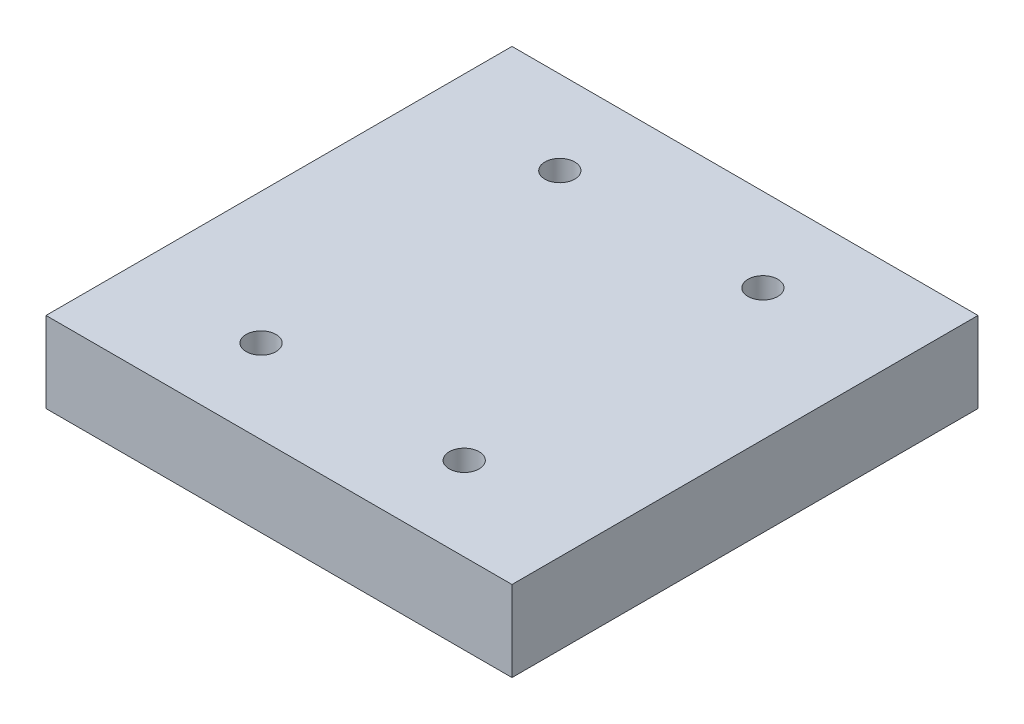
ISO-10303-21;
HEADER;
FILE_DESCRIPTION(('STEP AP214'),'2;1');
FILE_NAME('part.step','',(''),(''),'','','');
FILE_SCHEMA(('AUTOMOTIVE_DESIGN { 1 0 10303 214 1 1 1 1 }'));
ENDSEC;
DATA;
#1=APPLICATION_CONTEXT('core data for automotive mechanical design processes');
#2=APPLICATION_PROTOCOL_DEFINITION('international standard','automotive_design',2000,#1);
#3=PRODUCT_CONTEXT('',#1,'mechanical');
#4=PRODUCT('Part','Part','',(#3));
#5=PRODUCT_RELATED_PRODUCT_CATEGORY('part','',(#4));
#6=PRODUCT_DEFINITION_FORMATION('','',#4);
#7=PRODUCT_DEFINITION_CONTEXT('part definition',#1,'design');
#8=PRODUCT_DEFINITION('design','',#6,#7);
#9=PRODUCT_DEFINITION_SHAPE('','',#8);
#10=(LENGTH_UNIT() NAMED_UNIT(*) SI_UNIT(.MILLI.,.METRE.));
#11=(NAMED_UNIT(*) PLANE_ANGLE_UNIT() SI_UNIT($,.RADIAN.));
#12=(NAMED_UNIT(*) SI_UNIT($,.STERADIAN.) SOLID_ANGLE_UNIT());
#13=UNCERTAINTY_MEASURE_WITH_UNIT(LENGTH_MEASURE(1.E-05),#10,'distance_accuracy_value','');
#14=(GEOMETRIC_REPRESENTATION_CONTEXT(3) GLOBAL_UNCERTAINTY_ASSIGNED_CONTEXT((#13)) GLOBAL_UNIT_ASSIGNED_CONTEXT((#10,
#11,#12)) REPRESENTATION_CONTEXT('',''));
#15=CARTESIAN_POINT('',(0.,0.,0.));
#16=DIRECTION('',(0.,0.,1.));
#17=DIRECTION('',(1.,0.,0.));
#18=AXIS2_PLACEMENT_3D('',#15,#16,#17);
#19=CARTESIAN_POINT('',(78.,27.,78.));
#20=DIRECTION('',(-1.,0.,0.));
#21=DIRECTION('',(0.,0.,1.));
#22=AXIS2_PLACEMENT_3D('',#19,#20,#21);
#23=PLANE('',#22);
#24=DIRECTION('',(0.,0.,-1.));
#25=VECTOR('',#24,1.);
#26=CARTESIAN_POINT('',(78.,0.,78.));
#27=LINE('',#26,#25);
#28=CARTESIAN_POINT('',(78.,0.,78.));
#29=VERTEX_POINT('',#28);
#30=CARTESIAN_POINT('',(78.,0.,-78.));
#31=VERTEX_POINT('',#30);
#32=EDGE_CURVE('E94',#29,#31,#27,.T.);
#33=ORIENTED_EDGE('',*,*,#32,.T.);
#34=DIRECTION('',(0.,-1.,0.));
#35=VECTOR('',#34,1.);
#36=CARTESIAN_POINT('',(78.,27.,-78.));
#37=LINE('',#36,#35);
#38=CARTESIAN_POINT('',(78.,27.,-78.));
#39=VERTEX_POINT('',#38);
#40=EDGE_CURVE('E11',#39,#31,#37,.T.);
#41=ORIENTED_EDGE('',*,*,#40,.F.);
#42=DIRECTION('',(0.,0.,-1.));
#43=VECTOR('',#42,1.);
#44=CARTESIAN_POINT('',(78.,27.,78.));
#45=LINE('',#44,#43);
#46=CARTESIAN_POINT('',(78.,27.,78.));
#47=VERTEX_POINT('',#46);
#48=EDGE_CURVE('E82',#47,#39,#45,.T.);
#49=ORIENTED_EDGE('',*,*,#48,.F.);
#50=DIRECTION('',(0.,-1.,0.));
#51=VECTOR('',#50,1.);
#52=CARTESIAN_POINT('',(78.,27.,78.));
#53=LINE('',#52,#51);
#54=EDGE_CURVE('E90',#47,#29,#53,.T.);
#55=ORIENTED_EDGE('',*,*,#54,.T.);
#56=EDGE_LOOP('',(#33,#41,#49,#55));
#57=FACE_BOUND('',#56,.T.);
#58=ADVANCED_FACE('F31',(#57),#23,.F.);
#59=CARTESIAN_POINT('',(-78.,27.,-78.));
#60=DIRECTION('',(0.,0.,1.));
#61=DIRECTION('',(1.,0.,0.));
#62=AXIS2_PLACEMENT_3D('',#59,#60,#61);
#63=PLANE('',#62);
#64=DIRECTION('',(-1.,0.,0.));
#65=VECTOR('',#64,1.);
#66=CARTESIAN_POINT('',(-78.,0.,-78.));
#67=LINE('',#66,#65);
#68=CARTESIAN_POINT('',(-78.,0.,-78.));
#69=VERTEX_POINT('',#68);
#70=EDGE_CURVE('E86',#31,#69,#67,.T.);
#71=ORIENTED_EDGE('',*,*,#70,.T.);
#72=DIRECTION('',(0.,-1.,0.));
#73=VECTOR('',#72,1.);
#74=CARTESIAN_POINT('',(-78.,27.,-78.));
#75=LINE('',#74,#73);
#76=CARTESIAN_POINT('',(-78.,27.,-78.));
#77=VERTEX_POINT('',#76);
#78=EDGE_CURVE('E39',#77,#69,#75,.T.);
#79=ORIENTED_EDGE('',*,*,#78,.F.);
#80=DIRECTION('',(-1.,0.,0.));
#81=VECTOR('',#80,1.);
#82=CARTESIAN_POINT('',(-78.,27.,-78.));
#83=LINE('',#82,#81);
#84=EDGE_CURVE('E77',#39,#77,#83,.T.);
#85=ORIENTED_EDGE('',*,*,#84,.F.);
#86=ORIENTED_EDGE('',*,*,#40,.T.);
#87=EDGE_LOOP('',(#71,#79,#85,#86));
#88=FACE_BOUND('',#87,.T.);
#89=ADVANCED_FACE('F85',(#88),#63,.F.);
#90=CARTESIAN_POINT('',(-78.,27.,78.));
#91=DIRECTION('',(1.,0.,0.));
#92=DIRECTION('',(0.,0.,-1.));
#93=AXIS2_PLACEMENT_3D('',#90,#91,#92);
#94=PLANE('',#93);
#95=DIRECTION('',(0.,0.,1.));
#96=VECTOR('',#95,1.);
#97=CARTESIAN_POINT('',(-78.,0.,78.));
#98=LINE('',#97,#96);
#99=CARTESIAN_POINT('',(-78.,0.,78.));
#100=VERTEX_POINT('',#99);
#101=EDGE_CURVE('E64',#69,#100,#98,.T.);
#102=ORIENTED_EDGE('',*,*,#101,.T.);
#103=DIRECTION('',(0.,-1.,0.));
#104=VECTOR('',#103,1.);
#105=CARTESIAN_POINT('',(-78.,27.,78.));
#106=LINE('',#105,#104);
#107=CARTESIAN_POINT('',(-78.,27.,78.));
#108=VERTEX_POINT('',#107);
#109=EDGE_CURVE('E87',#108,#100,#106,.T.);
#110=ORIENTED_EDGE('',*,*,#109,.F.);
#111=DIRECTION('',(0.,0.,1.));
#112=VECTOR('',#111,1.);
#113=CARTESIAN_POINT('',(-78.,27.,78.));
#114=LINE('',#113,#112);
#115=EDGE_CURVE('E80',#77,#108,#114,.T.);
#116=ORIENTED_EDGE('',*,*,#115,.F.);
#117=ORIENTED_EDGE('',*,*,#78,.T.);
#118=EDGE_LOOP('',(#102,#110,#116,#117));
#119=FACE_BOUND('',#118,.T.);
#120=ADVANCED_FACE('F88',(#119),#94,.F.);
#121=CARTESIAN_POINT('',(-78.,27.,78.));
#122=DIRECTION('',(0.,0.,-1.));
#123=DIRECTION('',(-1.,0.,0.));
#124=AXIS2_PLACEMENT_3D('',#121,#122,#123);
#125=PLANE('',#124);
#126=DIRECTION('',(1.,0.,0.));
#127=VECTOR('',#126,1.);
#128=CARTESIAN_POINT('',(-78.,0.,78.));
#129=LINE('',#128,#127);
#130=EDGE_CURVE('E70',#100,#29,#129,.T.);
#131=ORIENTED_EDGE('',*,*,#130,.T.);
#132=ORIENTED_EDGE('',*,*,#54,.F.);
#133=DIRECTION('',(1.,0.,0.));
#134=VECTOR('',#133,1.);
#135=CARTESIAN_POINT('',(-78.,27.,78.));
#136=LINE('',#135,#134);
#137=EDGE_CURVE('E47',#108,#47,#136,.T.);
#138=ORIENTED_EDGE('',*,*,#137,.F.);
#139=ORIENTED_EDGE('',*,*,#109,.T.);
#140=EDGE_LOOP('',(#131,#132,#138,#139));
#141=FACE_BOUND('',#140,.T.);
#142=ADVANCED_FACE('F102',(#141),#125,.F.);
#143=CARTESIAN_POINT('',(78.,27.,-78.));
#144=DIRECTION('',(0.,-1.,0.));
#145=DIRECTION('',(0.,0.,-1.));
#146=AXIS2_PLACEMENT_3D('',#143,#144,#145);
#147=PLANE('',#146);
#148=CARTESIAN_POINT('',(-33.999999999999,27.,-50.0000000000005));
#149=DIRECTION('',(0.,-1.,0.));
#150=DIRECTION('',(0.,0.,-1.));
#151=AXIS2_PLACEMENT_3D('',#148,#149,#150);
#152=CIRCLE('',#151,5.);
#153=CARTESIAN_POINT('',(-33.999999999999,27.,-55.0000000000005));
#154=VERTEX_POINT('',#153);
#155=EDGE_CURVE('E123',#154,#154,#152,.T.);
#156=ORIENTED_EDGE('',*,*,#155,.T.);
#157=EDGE_LOOP('',(#156));
#158=FACE_BOUND('',#157,.T.);
#159=CARTESIAN_POINT('',(34.000000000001,27.,-50.));
#160=DIRECTION('',(0.,-1.,0.));
#161=DIRECTION('',(0.,0.,-1.));
#162=AXIS2_PLACEMENT_3D('',#159,#160,#161);
#163=CIRCLE('',#162,5.);
#164=CARTESIAN_POINT('',(34.000000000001,27.,-55.));
#165=VERTEX_POINT('',#164);
#166=EDGE_CURVE('E117',#165,#165,#163,.T.);
#167=ORIENTED_EDGE('',*,*,#166,.T.);
#168=EDGE_LOOP('',(#167));
#169=FACE_BOUND('',#168,.T.);
#170=CARTESIAN_POINT('',(-34.,27.,49.9999999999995));
#171=DIRECTION('',(0.,-1.,0.));
#172=DIRECTION('',(0.,0.,-1.));
#173=AXIS2_PLACEMENT_3D('',#170,#171,#172);
#174=CIRCLE('',#173,5.);
#175=CARTESIAN_POINT('',(-34.,27.,44.9999999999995));
#176=VERTEX_POINT('',#175);
#177=EDGE_CURVE('E111',#176,#176,#174,.T.);
#178=ORIENTED_EDGE('',*,*,#177,.T.);
#179=EDGE_LOOP('',(#178));
#180=FACE_BOUND('',#179,.T.);
#181=CARTESIAN_POINT('',(34.,27.,50.));
#182=DIRECTION('',(0.,-1.,0.));
#183=DIRECTION('',(0.,0.,-1.));
#184=AXIS2_PLACEMENT_3D('',#181,#182,#183);
#185=CIRCLE('',#184,5.);
#186=CARTESIAN_POINT('',(34.,27.,45.));
#187=VERTEX_POINT('',#186);
#188=EDGE_CURVE('E97',#187,#187,#185,.T.);
#189=ORIENTED_EDGE('',*,*,#188,.T.);
#190=EDGE_LOOP('',(#189));
#191=FACE_BOUND('',#190,.T.);
#192=ORIENTED_EDGE('',*,*,#48,.T.);
#193=ORIENTED_EDGE('',*,*,#84,.T.);
#194=ORIENTED_EDGE('',*,*,#115,.T.);
#195=ORIENTED_EDGE('',*,*,#137,.T.);
#196=EDGE_LOOP('',(#192,#193,#194,#195));
#197=FACE_BOUND('',#196,.T.);
#198=ADVANCED_FACE('F78',(#158,#169,#180,#191,#197),#147,.F.);
#199=CARTESIAN_POINT('',(78.,0.,-78.));
#200=DIRECTION('',(0.,-1.,0.));
#201=DIRECTION('',(0.,0.,-1.));
#202=AXIS2_PLACEMENT_3D('',#199,#200,#201);
#203=PLANE('',#202);
#204=CARTESIAN_POINT('',(-33.999999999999,0.,-50.0000000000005));
#205=DIRECTION('',(0.,-1.,0.));
#206=DIRECTION('',(0.,0.,-1.));
#207=AXIS2_PLACEMENT_3D('',#204,#205,#206);
#208=CIRCLE('',#207,5.);
#209=CARTESIAN_POINT('',(-33.999999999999,0.,-55.0000000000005));
#210=VERTEX_POINT('',#209);
#211=EDGE_CURVE('E126',#210,#210,#208,.T.);
#212=ORIENTED_EDGE('',*,*,#211,.F.);
#213=EDGE_LOOP('',(#212));
#214=FACE_BOUND('',#213,.T.);
#215=CARTESIAN_POINT('',(34.000000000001,0.,-50.));
#216=DIRECTION('',(0.,-1.,0.));
#217=DIRECTION('',(0.,0.,-1.));
#218=AXIS2_PLACEMENT_3D('',#215,#216,#217);
#219=CIRCLE('',#218,5.);
#220=CARTESIAN_POINT('',(34.000000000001,0.,-55.));
#221=VERTEX_POINT('',#220);
#222=EDGE_CURVE('E120',#221,#221,#219,.T.);
#223=ORIENTED_EDGE('',*,*,#222,.F.);
#224=EDGE_LOOP('',(#223));
#225=FACE_BOUND('',#224,.T.);
#226=CARTESIAN_POINT('',(-34.,0.,49.9999999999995));
#227=DIRECTION('',(0.,-1.,0.));
#228=DIRECTION('',(0.,0.,-1.));
#229=AXIS2_PLACEMENT_3D('',#226,#227,#228);
#230=CIRCLE('',#229,5.);
#231=CARTESIAN_POINT('',(-34.,0.,44.9999999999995));
#232=VERTEX_POINT('',#231);
#233=EDGE_CURVE('E114',#232,#232,#230,.T.);
#234=ORIENTED_EDGE('',*,*,#233,.F.);
#235=EDGE_LOOP('',(#234));
#236=FACE_BOUND('',#235,.T.);
#237=CARTESIAN_POINT('',(34.,0.,50.));
#238=DIRECTION('',(0.,-1.,0.));
#239=DIRECTION('',(0.,0.,-1.));
#240=AXIS2_PLACEMENT_3D('',#237,#238,#239);
#241=CIRCLE('',#240,5.);
#242=CARTESIAN_POINT('',(34.,0.,45.));
#243=VERTEX_POINT('',#242);
#244=EDGE_CURVE('E108',#243,#243,#241,.T.);
#245=ORIENTED_EDGE('',*,*,#244,.F.);
#246=EDGE_LOOP('',(#245));
#247=FACE_BOUND('',#246,.T.);
#248=ORIENTED_EDGE('',*,*,#32,.F.);
#249=ORIENTED_EDGE('',*,*,#130,.F.);
#250=ORIENTED_EDGE('',*,*,#101,.F.);
#251=ORIENTED_EDGE('',*,*,#70,.F.);
#252=EDGE_LOOP('',(#248,#249,#250,#251));
#253=FACE_BOUND('',#252,.T.);
#254=ADVANCED_FACE('F105',(#214,#225,#236,#247,#253),#203,.T.);
#255=CARTESIAN_POINT('',(34.,27.,50.));
#256=DIRECTION('',(0.,-1.,0.));
#257=DIRECTION('',(0.,0.,-1.));
#258=AXIS2_PLACEMENT_3D('',#255,#256,#257);
#259=CYLINDRICAL_SURFACE('',#258,5.);
#260=ORIENTED_EDGE('',*,*,#188,.F.);
#261=EDGE_LOOP('',(#260));
#262=FACE_BOUND('',#261,.T.);
#263=ORIENTED_EDGE('',*,*,#244,.T.);
#264=EDGE_LOOP('',(#263));
#265=FACE_BOUND('',#264,.T.);
#266=ADVANCED_FACE('F143',(#262,#265),#259,.F.);
#267=CARTESIAN_POINT('',(-34.,27.,49.9999999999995));
#268=DIRECTION('',(0.,-1.,0.));
#269=DIRECTION('',(0.,0.,-1.));
#270=AXIS2_PLACEMENT_3D('',#267,#268,#269);
#271=CYLINDRICAL_SURFACE('',#270,5.);
#272=ORIENTED_EDGE('',*,*,#177,.F.);
#273=EDGE_LOOP('',(#272));
#274=FACE_BOUND('',#273,.T.);
#275=ORIENTED_EDGE('',*,*,#233,.T.);
#276=EDGE_LOOP('',(#275));
#277=FACE_BOUND('',#276,.T.);
#278=ADVANCED_FACE('F152',(#274,#277),#271,.F.);
#279=CARTESIAN_POINT('',(34.000000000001,27.,-50.));
#280=DIRECTION('',(0.,-1.,0.));
#281=DIRECTION('',(0.,0.,-1.));
#282=AXIS2_PLACEMENT_3D('',#279,#280,#281);
#283=CYLINDRICAL_SURFACE('',#282,5.);
#284=ORIENTED_EDGE('',*,*,#166,.F.);
#285=EDGE_LOOP('',(#284));
#286=FACE_BOUND('',#285,.T.);
#287=ORIENTED_EDGE('',*,*,#222,.T.);
#288=EDGE_LOOP('',(#287));
#289=FACE_BOUND('',#288,.T.);
#290=ADVANCED_FACE('F137',(#286,#289),#283,.F.);
#291=CARTESIAN_POINT('',(-33.999999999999,27.,-50.0000000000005));
#292=DIRECTION('',(0.,-1.,0.));
#293=DIRECTION('',(0.,0.,-1.));
#294=AXIS2_PLACEMENT_3D('',#291,#292,#293);
#295=CYLINDRICAL_SURFACE('',#294,5.);
#296=ORIENTED_EDGE('',*,*,#155,.F.);
#297=EDGE_LOOP('',(#296));
#298=FACE_BOUND('',#297,.T.);
#299=ORIENTED_EDGE('',*,*,#211,.T.);
#300=EDGE_LOOP('',(#299));
#301=FACE_BOUND('',#300,.T.);
#302=ADVANCED_FACE('F134',(#298,#301),#295,.F.);
#303=CLOSED_SHELL('',(#58,#89,#120,#142,#198,#254,#266,#278,#290,#302));
#304=MANIFOLD_SOLID_BREP('B2',#303);
#305=ADVANCED_BREP_SHAPE_REPRESENTATION('',(#18,#304),#14);
#306=SHAPE_DEFINITION_REPRESENTATION(#9,#305);
ENDSEC;
END-ISO-10303-21;
